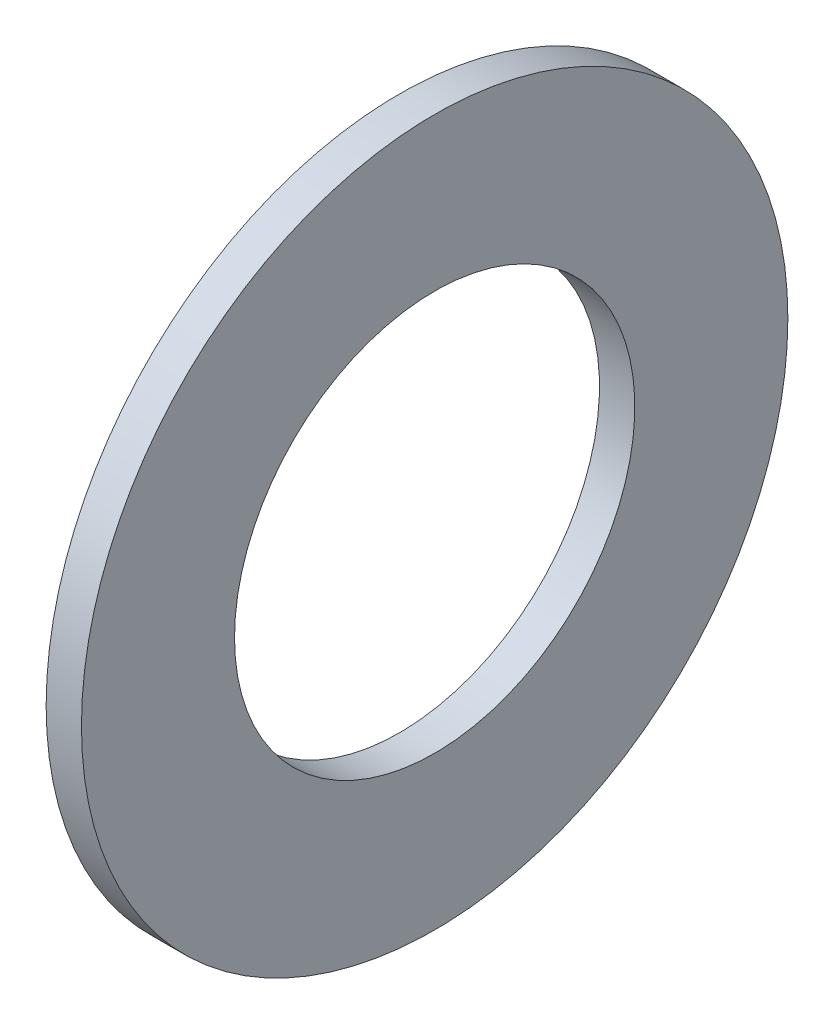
ISO-10303-21;
HEADER;
FILE_DESCRIPTION(('STEP AP214'),'2;1');
FILE_NAME('part.step','',(''),(''),'','','');
FILE_SCHEMA(('AUTOMOTIVE_DESIGN { 1 0 10303 214 1 1 1 1 }'));
ENDSEC;
DATA;
#1=APPLICATION_CONTEXT('core data for automotive mechanical design processes');
#2=APPLICATION_PROTOCOL_DEFINITION('international standard','automotive_design',2000,#1);
#3=PRODUCT_CONTEXT('',#1,'mechanical');
#4=PRODUCT('Part','Part','',(#3));
#5=PRODUCT_RELATED_PRODUCT_CATEGORY('part','',(#4));
#6=PRODUCT_DEFINITION_FORMATION('','',#4);
#7=PRODUCT_DEFINITION_CONTEXT('part definition',#1,'design');
#8=PRODUCT_DEFINITION('design','',#6,#7);
#9=PRODUCT_DEFINITION_SHAPE('','',#8);
#10=(LENGTH_UNIT() NAMED_UNIT(*) SI_UNIT(.MILLI.,.METRE.));
#11=(NAMED_UNIT(*) PLANE_ANGLE_UNIT() SI_UNIT($,.RADIAN.));
#12=(NAMED_UNIT(*) SI_UNIT($,.STERADIAN.) SOLID_ANGLE_UNIT());
#13=UNCERTAINTY_MEASURE_WITH_UNIT(LENGTH_MEASURE(1.E-05),#10,'distance_accuracy_value','');
#14=(GEOMETRIC_REPRESENTATION_CONTEXT(3) GLOBAL_UNCERTAINTY_ASSIGNED_CONTEXT((#13)) GLOBAL_UNIT_ASSIGNED_CONTEXT((#10,
#11,#12)) REPRESENTATION_CONTEXT('',''));
#15=CARTESIAN_POINT('',(0.,0.,0.));
#16=DIRECTION('',(0.,0.,1.));
#17=DIRECTION('',(1.,0.,0.));
#18=AXIS2_PLACEMENT_3D('',#15,#16,#17);
#19=CARTESIAN_POINT('',(0.,0.,-15.));
#20=DIRECTION('',(1.,0.,0.));
#21=DIRECTION('',(0.,0.,-1.));
#22=AXIS2_PLACEMENT_3D('',#19,#20,#21);
#23=PLANE('',#22);
#24=CARTESIAN_POINT('',(0.,0.,0.));
#25=DIRECTION('',(-1.,0.,0.));
#26=DIRECTION('',(0.,0.,1.));
#27=AXIS2_PLACEMENT_3D('',#24,#25,#26);
#28=CIRCLE('',#27,8.5);
#29=CARTESIAN_POINT('',(0.,0.,8.5));
#30=VERTEX_POINT('',#29);
#31=EDGE_CURVE('E10',#30,#30,#28,.T.);
#32=ORIENTED_EDGE('',*,*,#31,.F.);
#33=EDGE_LOOP('',(#32));
#34=FACE_BOUND('',#33,.T.);
#35=CARTESIAN_POINT('',(0.,0.,0.));
#36=DIRECTION('',(-1.,0.,0.));
#37=DIRECTION('',(0.,0.,1.));
#38=AXIS2_PLACEMENT_3D('',#35,#36,#37);
#39=CIRCLE('',#38,15.);
#40=CARTESIAN_POINT('',(0.,0.,15.));
#41=VERTEX_POINT('',#40);
#42=EDGE_CURVE('E43',#41,#41,#39,.T.);
#43=ORIENTED_EDGE('',*,*,#42,.T.);
#44=EDGE_LOOP('',(#43));
#45=FACE_BOUND('',#44,.T.);
#46=ADVANCED_FACE('F29',(#34,#45),#23,.F.);
#47=CARTESIAN_POINT('',(0.,0.,0.));
#48=DIRECTION('',(-1.,0.,0.));
#49=DIRECTION('',(0.,0.,1.));
#50=AXIS2_PLACEMENT_3D('',#47,#48,#49);
#51=CYLINDRICAL_SURFACE('',#50,8.5);
#52=CARTESIAN_POINT('',(1.5,0.,0.));
#53=DIRECTION('',(-1.,0.,0.));
#54=DIRECTION('',(0.,0.,1.));
#55=AXIS2_PLACEMENT_3D('',#52,#53,#54);
#56=CIRCLE('',#55,8.5);
#57=CARTESIAN_POINT('',(1.5,0.,8.5));
#58=VERTEX_POINT('',#57);
#59=EDGE_CURVE('E35',#58,#58,#56,.T.);
#60=ORIENTED_EDGE('',*,*,#59,.F.);
#61=EDGE_LOOP('',(#60));
#62=FACE_BOUND('',#61,.T.);
#63=ORIENTED_EDGE('',*,*,#31,.T.);
#64=EDGE_LOOP('',(#63));
#65=FACE_BOUND('',#64,.T.);
#66=ADVANCED_FACE('F58',(#62,#65),#51,.F.);
#67=CARTESIAN_POINT('',(1.5,0.,-15.));
#68=DIRECTION('',(-1.,0.,0.));
#69=DIRECTION('',(0.,0.,1.));
#70=AXIS2_PLACEMENT_3D('',#67,#68,#69);
#71=PLANE('',#70);
#72=CARTESIAN_POINT('',(1.5,0.,0.));
#73=DIRECTION('',(-1.,0.,0.));
#74=DIRECTION('',(0.,0.,1.));
#75=AXIS2_PLACEMENT_3D('',#72,#73,#74);
#76=CIRCLE('',#75,15.);
#77=CARTESIAN_POINT('',(1.5,0.,15.));
#78=VERTEX_POINT('',#77);
#79=EDGE_CURVE('E39',#78,#78,#76,.T.);
#80=ORIENTED_EDGE('',*,*,#79,.F.);
#81=EDGE_LOOP('',(#80));
#82=FACE_BOUND('',#81,.T.);
#83=ORIENTED_EDGE('',*,*,#59,.T.);
#84=EDGE_LOOP('',(#83));
#85=FACE_BOUND('',#84,.T.);
#86=ADVANCED_FACE('F53',(#82,#85),#71,.F.);
#87=CARTESIAN_POINT('',(0.,0.,0.));
#88=DIRECTION('',(-1.,0.,0.));
#89=DIRECTION('',(0.,0.,1.));
#90=AXIS2_PLACEMENT_3D('',#87,#88,#89);
#91=CYLINDRICAL_SURFACE('',#90,15.);
#92=ORIENTED_EDGE('',*,*,#42,.F.);
#93=EDGE_LOOP('',(#92));
#94=FACE_BOUND('',#93,.T.);
#95=ORIENTED_EDGE('',*,*,#79,.T.);
#96=EDGE_LOOP('',(#95));
#97=FACE_BOUND('',#96,.T.);
#98=ADVANCED_FACE('F50',(#94,#97),#91,.T.);
#99=CLOSED_SHELL('',(#46,#66,#86,#98));
#100=MANIFOLD_SOLID_BREP('B2',#99);
#101=ADVANCED_BREP_SHAPE_REPRESENTATION('',(#18,#100),#14);
#102=SHAPE_DEFINITION_REPRESENTATION(#9,#101);
ENDSEC;
END-ISO-10303-21;
